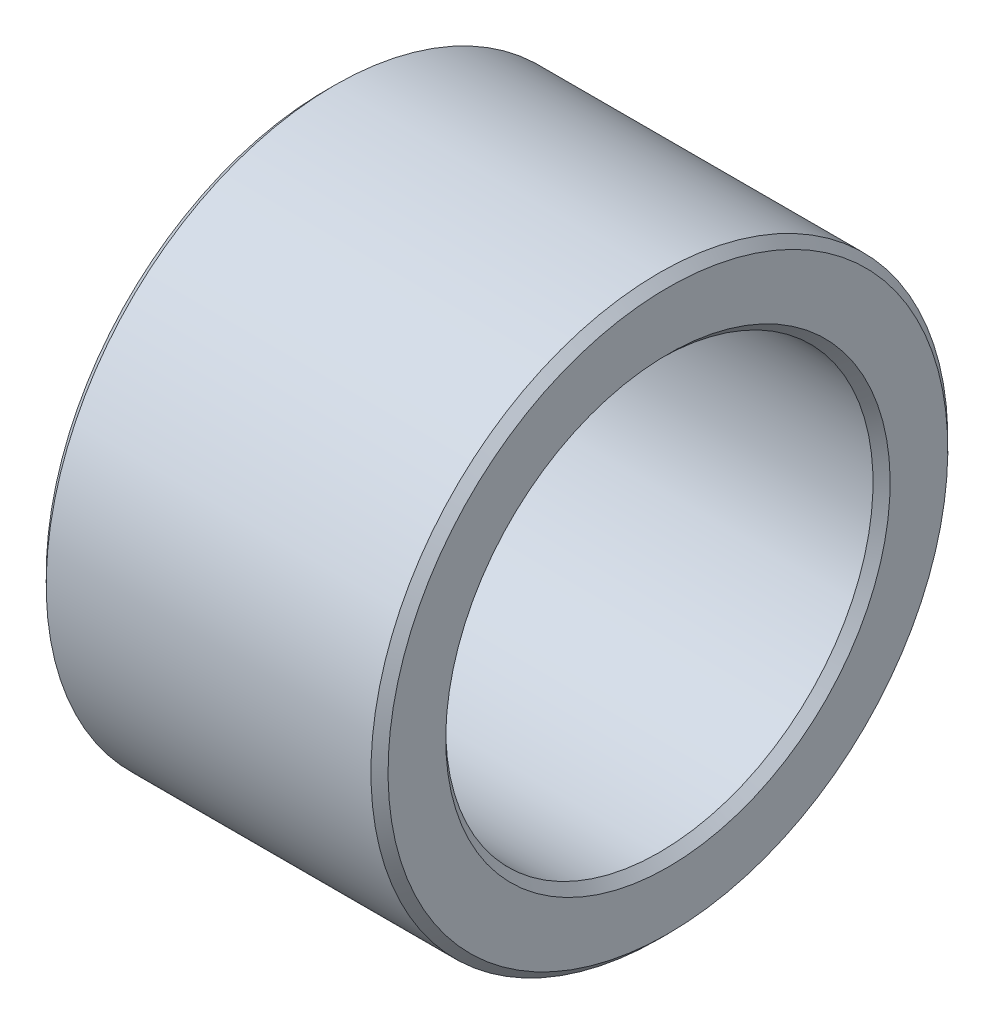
ISO-10303-21;
HEADER;
FILE_DESCRIPTION(('STEP AP214'),'2;1');
FILE_NAME('part.step','',(''),(''),'','','');
FILE_SCHEMA(('AUTOMOTIVE_DESIGN { 1 0 10303 214 1 1 1 1 }'));
ENDSEC;
DATA;
#1=APPLICATION_CONTEXT('core data for automotive mechanical design processes');
#2=APPLICATION_PROTOCOL_DEFINITION('international standard','automotive_design',2000,#1);
#3=PRODUCT_CONTEXT('',#1,'mechanical');
#4=PRODUCT('Part','Part','',(#3));
#5=PRODUCT_RELATED_PRODUCT_CATEGORY('part','',(#4));
#6=PRODUCT_DEFINITION_FORMATION('','',#4);
#7=PRODUCT_DEFINITION_CONTEXT('part definition',#1,'design');
#8=PRODUCT_DEFINITION('design','',#6,#7);
#9=PRODUCT_DEFINITION_SHAPE('','',#8);
#10=(LENGTH_UNIT() NAMED_UNIT(*) SI_UNIT(.MILLI.,.METRE.));
#11=(NAMED_UNIT(*) PLANE_ANGLE_UNIT() SI_UNIT($,.RADIAN.));
#12=(NAMED_UNIT(*) SI_UNIT($,.STERADIAN.) SOLID_ANGLE_UNIT());
#13=UNCERTAINTY_MEASURE_WITH_UNIT(LENGTH_MEASURE(1.E-05),#10,'distance_accuracy_value','');
#14=(GEOMETRIC_REPRESENTATION_CONTEXT(3) GLOBAL_UNCERTAINTY_ASSIGNED_CONTEXT((#13)) GLOBAL_UNIT_ASSIGNED_CONTEXT((#10,
#11,#12)) REPRESENTATION_CONTEXT('',''));
#15=CARTESIAN_POINT('',(0.,0.,0.));
#16=DIRECTION('',(0.,0.,1.));
#17=DIRECTION('',(1.,0.,0.));
#18=AXIS2_PLACEMENT_3D('',#15,#16,#17);
#19=CARTESIAN_POINT('',(0.,-11.75,0.));
#20=DIRECTION('',(-1.,0.,0.));
#21=DIRECTION('',(0.,1.,0.));
#22=AXIS2_PLACEMENT_3D('',#19,#20,#21);
#23=PLANE('',#22);
#24=CARTESIAN_POINT('',(0.,0.,0.));
#25=DIRECTION('',(1.,0.,0.));
#26=DIRECTION('',(0.,-1.,0.));
#27=AXIS2_PLACEMENT_3D('',#24,#25,#26);
#28=CIRCLE('',#27,10.4);
#29=CARTESIAN_POINT('',(0.,-10.4,0.));
#30=VERTEX_POINT('',#29);
#31=EDGE_CURVE('E9',#30,#30,#28,.T.);
#32=ORIENTED_EDGE('',*,*,#31,.T.);
#33=EDGE_LOOP('',(#32));
#34=FACE_BOUND('',#33,.T.);
#35=CARTESIAN_POINT('',(0.,0.,0.));
#36=DIRECTION('',(1.,0.,0.));
#37=DIRECTION('',(0.,-1.,0.));
#38=AXIS2_PLACEMENT_3D('',#35,#36,#37);
#39=CIRCLE('',#38,13.1);
#40=CARTESIAN_POINT('',(0.,-13.1,0.));
#41=VERTEX_POINT('',#40);
#42=EDGE_CURVE('E53',#41,#41,#39,.T.);
#43=ORIENTED_EDGE('',*,*,#42,.F.);
#44=EDGE_LOOP('',(#43));
#45=FACE_BOUND('',#44,.T.);
#46=ADVANCED_FACE('F15',(#34,#45),#23,.T.);
#47=CARTESIAN_POINT('',(0.2,0.,0.));
#48=DIRECTION('',(-1.,0.,0.));
#49=DIRECTION('',(0.,-1.,0.));
#50=AXIS2_PLACEMENT_3D('',#47,#48,#49);
#51=CONICAL_SURFACE('',#50,10.2,0.785398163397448);
#52=CARTESIAN_POINT('',(0.4,0.,0.));
#53=DIRECTION('',(1.,0.,0.));
#54=DIRECTION('',(0.,-1.,0.));
#55=AXIS2_PLACEMENT_3D('',#52,#53,#54);
#56=CIRCLE('',#55,10.);
#57=CARTESIAN_POINT('',(0.4,-10.,0.));
#58=VERTEX_POINT('',#57);
#59=EDGE_CURVE('E22',#58,#58,#56,.T.);
#60=ORIENTED_EDGE('',*,*,#59,.T.);
#61=EDGE_LOOP('',(#60));
#62=FACE_BOUND('',#61,.T.);
#63=ORIENTED_EDGE('',*,*,#31,.F.);
#64=EDGE_LOOP('',(#63));
#65=FACE_BOUND('',#64,.T.);
#66=ADVANCED_FACE('F82',(#62,#65),#51,.F.);
#67=CARTESIAN_POINT('',(8.,0.,0.));
#68=DIRECTION('',(-1.,0.,0.));
#69=DIRECTION('',(0.,-1.,0.));
#70=AXIS2_PLACEMENT_3D('',#67,#68,#69);
#71=CYLINDRICAL_SURFACE('',#70,10.);
#72=CARTESIAN_POINT('',(15.6,0.,0.));
#73=DIRECTION('',(1.,0.,0.));
#74=DIRECTION('',(0.,-1.,0.));
#75=AXIS2_PLACEMENT_3D('',#72,#73,#74);
#76=CIRCLE('',#75,10.);
#77=CARTESIAN_POINT('',(15.6,-10.,0.));
#78=VERTEX_POINT('',#77);
#79=EDGE_CURVE('E58',#78,#78,#76,.T.);
#80=ORIENTED_EDGE('',*,*,#79,.T.);
#81=EDGE_LOOP('',(#80));
#82=FACE_BOUND('',#81,.T.);
#83=ORIENTED_EDGE('',*,*,#59,.F.);
#84=EDGE_LOOP('',(#83));
#85=FACE_BOUND('',#84,.T.);
#86=ADVANCED_FACE('F66',(#82,#85),#71,.F.);
#87=CARTESIAN_POINT('',(15.8,0.,0.));
#88=DIRECTION('',(1.,0.,0.));
#89=DIRECTION('',(0.,-1.,0.));
#90=AXIS2_PLACEMENT_3D('',#87,#88,#89);
#91=CONICAL_SURFACE('',#90,10.2,0.785398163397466);
#92=CARTESIAN_POINT('',(16.,0.,0.));
#93=DIRECTION('',(1.,0.,0.));
#94=DIRECTION('',(0.,-1.,0.));
#95=AXIS2_PLACEMENT_3D('',#92,#93,#94);
#96=CIRCLE('',#95,10.4);
#97=CARTESIAN_POINT('',(16.,-10.4,0.));
#98=VERTEX_POINT('',#97);
#99=EDGE_CURVE('E63',#98,#98,#96,.T.);
#100=ORIENTED_EDGE('',*,*,#99,.T.);
#101=EDGE_LOOP('',(#100));
#102=FACE_BOUND('',#101,.T.);
#103=ORIENTED_EDGE('',*,*,#79,.F.);
#104=EDGE_LOOP('',(#103));
#105=FACE_BOUND('',#104,.T.);
#106=ADVANCED_FACE('F69',(#102,#105),#91,.F.);
#107=CARTESIAN_POINT('',(16.,-11.75,0.));
#108=DIRECTION('',(1.,0.,0.));
#109=DIRECTION('',(0.,-1.,0.));
#110=AXIS2_PLACEMENT_3D('',#107,#108,#109);
#111=PLANE('',#110);
#112=CARTESIAN_POINT('',(16.,0.,0.));
#113=DIRECTION('',(1.,0.,0.));
#114=DIRECTION('',(0.,-1.,0.));
#115=AXIS2_PLACEMENT_3D('',#112,#113,#114);
#116=CIRCLE('',#115,13.1);
#117=CARTESIAN_POINT('',(16.,-13.1,0.));
#118=VERTEX_POINT('',#117);
#119=EDGE_CURVE('E61',#118,#118,#116,.T.);
#120=ORIENTED_EDGE('',*,*,#119,.T.);
#121=EDGE_LOOP('',(#120));
#122=FACE_BOUND('',#121,.T.);
#123=ORIENTED_EDGE('',*,*,#99,.F.);
#124=EDGE_LOOP('',(#123));
#125=FACE_BOUND('',#124,.T.);
#126=ADVANCED_FACE('F71',(#122,#125),#111,.T.);
#127=CARTESIAN_POINT('',(15.8,0.,0.));
#128=DIRECTION('',(-1.,0.,0.));
#129=DIRECTION('',(0.,-1.,0.));
#130=AXIS2_PLACEMENT_3D('',#127,#128,#129);
#131=CONICAL_SURFACE('',#130,13.3,0.785398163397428);
#132=CARTESIAN_POINT('',(15.6,0.,0.));
#133=DIRECTION('',(1.,0.,0.));
#134=DIRECTION('',(0.,-1.,0.));
#135=AXIS2_PLACEMENT_3D('',#132,#133,#134);
#136=CIRCLE('',#135,13.5);
#137=CARTESIAN_POINT('',(15.6,-13.5,0.));
#138=VERTEX_POINT('',#137);
#139=EDGE_CURVE('E55',#138,#138,#136,.T.);
#140=ORIENTED_EDGE('',*,*,#139,.T.);
#141=EDGE_LOOP('',(#140));
#142=FACE_BOUND('',#141,.T.);
#143=ORIENTED_EDGE('',*,*,#119,.F.);
#144=EDGE_LOOP('',(#143));
#145=FACE_BOUND('',#144,.T.);
#146=ADVANCED_FACE('F79',(#142,#145),#131,.T.);
#147=CARTESIAN_POINT('',(8.,0.,0.));
#148=DIRECTION('',(-1.,0.,0.));
#149=DIRECTION('',(0.,-1.,0.));
#150=AXIS2_PLACEMENT_3D('',#147,#148,#149);
#151=CYLINDRICAL_SURFACE('',#150,13.5);
#152=CARTESIAN_POINT('',(0.4,0.,0.));
#153=DIRECTION('',(1.,0.,0.));
#154=DIRECTION('',(0.,-1.,0.));
#155=AXIS2_PLACEMENT_3D('',#152,#153,#154);
#156=CIRCLE('',#155,13.5);
#157=CARTESIAN_POINT('',(0.4,-13.5,0.));
#158=VERTEX_POINT('',#157);
#159=EDGE_CURVE('E49',#158,#158,#156,.T.);
#160=ORIENTED_EDGE('',*,*,#159,.T.);
#161=EDGE_LOOP('',(#160));
#162=FACE_BOUND('',#161,.T.);
#163=ORIENTED_EDGE('',*,*,#139,.F.);
#164=EDGE_LOOP('',(#163));
#165=FACE_BOUND('',#164,.T.);
#166=ADVANCED_FACE('F50',(#162,#165),#151,.T.);
#167=CARTESIAN_POINT('',(0.2,0.,0.));
#168=DIRECTION('',(1.,0.,0.));
#169=DIRECTION('',(0.,-1.,0.));
#170=AXIS2_PLACEMENT_3D('',#167,#168,#169);
#171=CONICAL_SURFACE('',#170,13.3,0.78539816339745);
#172=ORIENTED_EDGE('',*,*,#42,.T.);
#173=EDGE_LOOP('',(#172));
#174=FACE_BOUND('',#173,.T.);
#175=ORIENTED_EDGE('',*,*,#159,.F.);
#176=EDGE_LOOP('',(#175));
#177=FACE_BOUND('',#176,.T.);
#178=ADVANCED_FACE('F92',(#174,#177),#171,.T.);
#179=CLOSED_SHELL('',(#46,#66,#86,#106,#126,#146,#166,#178));
#180=MANIFOLD_SOLID_BREP('B1',#179);
#181=ADVANCED_BREP_SHAPE_REPRESENTATION('',(#18,#180),#14);
#182=SHAPE_DEFINITION_REPRESENTATION(#9,#181);
ENDSEC;
END-ISO-10303-21;
